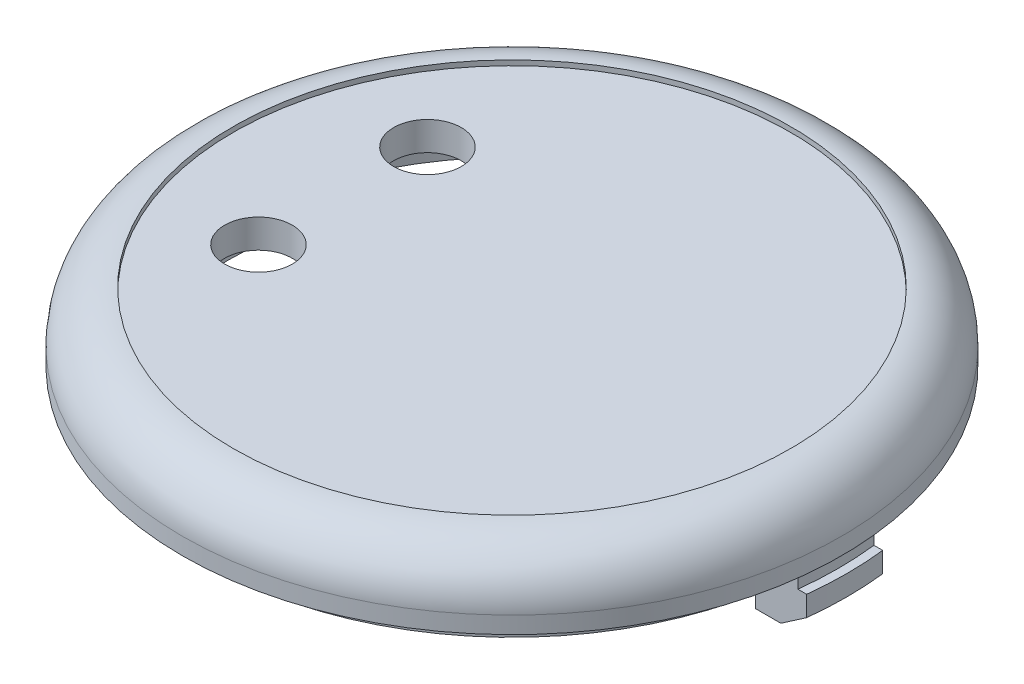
ISO-10303-21;
HEADER;
FILE_DESCRIPTION(('STEP AP214'),'2;1');
FILE_NAME('part.step','',(''),(''),'','','');
FILE_SCHEMA(('AUTOMOTIVE_DESIGN { 1 0 10303 214 1 1 1 1 }'));
ENDSEC;
DATA;
#1=APPLICATION_CONTEXT('core data for automotive mechanical design processes');
#2=APPLICATION_PROTOCOL_DEFINITION('international standard','automotive_design',2000,#1);
#3=PRODUCT_CONTEXT('',#1,'mechanical');
#4=PRODUCT('Part','Part','',(#3));
#5=PRODUCT_RELATED_PRODUCT_CATEGORY('part','',(#4));
#6=PRODUCT_DEFINITION_FORMATION('','',#4);
#7=PRODUCT_DEFINITION_CONTEXT('part definition',#1,'design');
#8=PRODUCT_DEFINITION('design','',#6,#7);
#9=PRODUCT_DEFINITION_SHAPE('','',#8);
#10=(LENGTH_UNIT() NAMED_UNIT(*) SI_UNIT(.MILLI.,.METRE.));
#11=(NAMED_UNIT(*) PLANE_ANGLE_UNIT() SI_UNIT($,.RADIAN.));
#12=(NAMED_UNIT(*) SI_UNIT($,.STERADIAN.) SOLID_ANGLE_UNIT());
#13=UNCERTAINTY_MEASURE_WITH_UNIT(LENGTH_MEASURE(1.E-05),#10,'distance_accuracy_value','');
#14=(GEOMETRIC_REPRESENTATION_CONTEXT(3) GLOBAL_UNCERTAINTY_ASSIGNED_CONTEXT((#13)) GLOBAL_UNIT_ASSIGNED_CONTEXT((#10,
#11,#12)) REPRESENTATION_CONTEXT('',''));
#15=CARTESIAN_POINT('',(0.,0.,0.));
#16=DIRECTION('',(0.,0.,1.));
#17=DIRECTION('',(1.,0.,0.));
#18=AXIS2_PLACEMENT_3D('',#15,#16,#17);
#19=CARTESIAN_POINT('',(0.,-0.75,0.));
#20=DIRECTION('',(0.,1.,0.));
#21=DIRECTION('',(0.,0.,1.));
#22=AXIS2_PLACEMENT_3D('',#19,#20,#21);
#23=PLANE('',#22);
#24=CARTESIAN_POINT('',(0.,-0.75,0.));
#25=DIRECTION('',(0.,1.,0.));
#26=DIRECTION('',(0.,0.,1.));
#27=AXIS2_PLACEMENT_3D('',#24,#25,#26);
#28=CIRCLE('',#27,19.81639257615);
#29=CARTESIAN_POINT('',(-19.6882430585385,-0.75,2.25000000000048));
#30=VERTEX_POINT('',#29);
#31=CARTESIAN_POINT('',(-19.6882430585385,-0.75,-2.25000000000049));
#32=VERTEX_POINT('',#31);
#33=EDGE_CURVE('E187',#30,#32,#28,.F.);
#34=ORIENTED_EDGE('',*,*,#33,.F.);
#35=DIRECTION('',(1.,0.,0.));
#36=VECTOR('',#35,1.);
#37=CARTESIAN_POINT('',(0.,-0.75,2.25));
#38=LINE('',#37,#36);
#39=CARTESIAN_POINT('',(-19.1683984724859,-0.75,2.24999999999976));
#40=VERTEX_POINT('',#39);
#41=EDGE_CURVE('E201',#30,#40,#38,.T.);
#42=ORIENTED_EDGE('',*,*,#41,.T.);
#43=CARTESIAN_POINT('',(0.,-0.75,0.));
#44=DIRECTION('',(0.,1.,0.));
#45=DIRECTION('',(0.,0.,1.));
#46=AXIS2_PLACEMENT_3D('',#43,#44,#45);
#47=CIRCLE('',#46,19.3);
#48=CARTESIAN_POINT('',(-19.1683984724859,-0.75,-2.24999999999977));
#49=VERTEX_POINT('',#48);
#50=EDGE_CURVE('E423',#49,#40,#47,.T.);
#51=ORIENTED_EDGE('',*,*,#50,.F.);
#52=DIRECTION('',(1.,0.,0.));
#53=VECTOR('',#52,1.);
#54=CARTESIAN_POINT('',(0.,-0.75,-2.25));
#55=LINE('',#54,#53);
#56=EDGE_CURVE('E203',#49,#32,#55,.F.);
#57=ORIENTED_EDGE('',*,*,#56,.T.);
#58=EDGE_LOOP('',(#34,#42,#51,#57));
#59=FACE_BOUND('',#58,.T.);
#60=ADVANCED_FACE('F17',(#59),#23,.T.);
#61=CARTESIAN_POINT('',(0.,-0.75,0.));
#62=DIRECTION('',(0.,1.,0.));
#63=DIRECTION('',(0.,0.,1.));
#64=AXIS2_PLACEMENT_3D('',#61,#62,#63);
#65=PLANE('',#64);
#66=CARTESIAN_POINT('',(0.,-0.75,0.));
#67=DIRECTION('',(0.,1.,0.));
#68=DIRECTION('',(0.,0.,1.));
#69=AXIS2_PLACEMENT_3D('',#66,#67,#68);
#70=CIRCLE('',#69,19.3);
#71=CARTESIAN_POINT('',(19.1683984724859,-0.75,2.24999999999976));
#72=VERTEX_POINT('',#71);
#73=CARTESIAN_POINT('',(19.1683984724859,-0.75,-2.24999999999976));
#74=VERTEX_POINT('',#73);
#75=EDGE_CURVE('E174',#72,#74,#70,.T.);
#76=ORIENTED_EDGE('',*,*,#75,.F.);
#77=DIRECTION('',(1.,0.,0.));
#78=VECTOR('',#77,1.);
#79=CARTESIAN_POINT('',(0.,-0.75,2.25));
#80=LINE('',#79,#78);
#81=CARTESIAN_POINT('',(19.6882430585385,-0.75,2.25000000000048));
#82=VERTEX_POINT('',#81);
#83=EDGE_CURVE('E168',#72,#82,#80,.T.);
#84=ORIENTED_EDGE('',*,*,#83,.T.);
#85=CARTESIAN_POINT('',(0.,-0.75,0.));
#86=DIRECTION('',(0.,1.,0.));
#87=DIRECTION('',(0.,0.,1.));
#88=AXIS2_PLACEMENT_3D('',#85,#86,#87);
#89=CIRCLE('',#88,19.81639257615);
#90=CARTESIAN_POINT('',(19.6882430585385,-0.75,-2.25000000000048));
#91=VERTEX_POINT('',#90);
#92=EDGE_CURVE('E20',#91,#82,#89,.F.);
#93=ORIENTED_EDGE('',*,*,#92,.F.);
#94=DIRECTION('',(1.,0.,0.));
#95=VECTOR('',#94,1.);
#96=CARTESIAN_POINT('',(0.,-0.75,-2.25));
#97=LINE('',#96,#95);
#98=EDGE_CURVE('E163',#91,#74,#97,.F.);
#99=ORIENTED_EDGE('',*,*,#98,.T.);
#100=EDGE_LOOP('',(#76,#84,#93,#99));
#101=FACE_BOUND('',#100,.T.);
#102=ADVANCED_FACE('F170',(#101),#65,.T.);
#103=CARTESIAN_POINT('',(0.,-3.15,0.));
#104=DIRECTION('',(0.,1.,0.));
#105=DIRECTION('',(0.,0.,1.));
#106=AXIS2_PLACEMENT_3D('',#103,#104,#105);
#107=CYLINDRICAL_SURFACE('',#106,19.81639257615);
#108=ORIENTED_EDGE('',*,*,#92,.T.);
#109=DIRECTION('',(0.,1.,0.));
#110=VECTOR('',#109,1.);
#111=CARTESIAN_POINT('',(19.6882430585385,-3.15,2.25000000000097));
#112=LINE('',#111,#110);
#113=CARTESIAN_POINT('',(19.6882430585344,-1.94999999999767,2.25000000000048));
#114=VERTEX_POINT('',#113);
#115=EDGE_CURVE('E180',#82,#114,#112,.F.);
#116=ORIENTED_EDGE('',*,*,#115,.T.);
#117=CARTESIAN_POINT('',(0.,-1.9500000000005,0.));
#118=DIRECTION('',(0.,1.,0.));
#119=DIRECTION('',(-0.990268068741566,0.,-0.139173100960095));
#120=AXIS2_PLACEMENT_3D('',#117,#118,#119);
#121=CIRCLE('',#120,19.8163925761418);
#122=CARTESIAN_POINT('',(19.6882430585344,-1.94999999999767,-2.25000000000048));
#123=VERTEX_POINT('',#122);
#124=EDGE_CURVE('E197',#123,#114,#121,.F.);
#125=ORIENTED_EDGE('',*,*,#124,.F.);
#126=DIRECTION('',(0.,1.,0.));
#127=VECTOR('',#126,1.);
#128=CARTESIAN_POINT('',(19.6882430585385,-3.15,-2.25000000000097));
#129=LINE('',#128,#127);
#130=EDGE_CURVE('E177',#123,#91,#129,.T.);
#131=ORIENTED_EDGE('',*,*,#130,.T.);
#132=EDGE_LOOP('',(#108,#116,#125,#131));
#133=FACE_BOUND('',#132,.T.);
#134=ADVANCED_FACE('F189',(#133),#107,.T.);
#135=CARTESIAN_POINT('',(0.,-3.15,0.));
#136=DIRECTION('',(0.,1.,0.));
#137=DIRECTION('',(0.,0.,1.));
#138=AXIS2_PLACEMENT_3D('',#135,#136,#137);
#139=CYLINDRICAL_SURFACE('',#138,19.81639257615);
#140=CARTESIAN_POINT('',(0.,-1.9500000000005,0.));
#141=DIRECTION('',(0.,1.,0.));
#142=DIRECTION('',(0.990268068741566,0.,0.139173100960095));
#143=AXIS2_PLACEMENT_3D('',#140,#141,#142);
#144=CIRCLE('',#143,19.8163925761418);
#145=CARTESIAN_POINT('',(-19.6882430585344,-1.94999999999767,2.25000000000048));
#146=VERTEX_POINT('',#145);
#147=CARTESIAN_POINT('',(-19.6882430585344,-1.94999999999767,-2.25000000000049));
#148=VERTEX_POINT('',#147);
#149=EDGE_CURVE('E399',#146,#148,#144,.F.);
#150=ORIENTED_EDGE('',*,*,#149,.F.);
#151=DIRECTION('',(0.,1.,0.));
#152=VECTOR('',#151,1.);
#153=CARTESIAN_POINT('',(-19.6882430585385,-3.15,2.25000000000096));
#154=LINE('',#153,#152);
#155=EDGE_CURVE('E426',#146,#30,#154,.T.);
#156=ORIENTED_EDGE('',*,*,#155,.T.);
#157=ORIENTED_EDGE('',*,*,#33,.T.);
#158=DIRECTION('',(0.,1.,0.));
#159=VECTOR('',#158,1.);
#160=CARTESIAN_POINT('',(-19.6882430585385,-3.15,-2.25000000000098));
#161=LINE('',#160,#159);
#162=EDGE_CURVE('E192',#32,#148,#161,.F.);
#163=ORIENTED_EDGE('',*,*,#162,.T.);
#164=EDGE_LOOP('',(#150,#156,#157,#163));
#165=FACE_BOUND('',#164,.T.);
#166=ADVANCED_FACE('F646',(#165),#139,.T.);
#167=CARTESIAN_POINT('',(0.,0.,0.));
#168=DIRECTION('',(0.,1.,0.));
#169=DIRECTION('',(0.,0.,1.));
#170=AXIS2_PLACEMENT_3D('',#167,#168,#169);
#171=CYLINDRICAL_SURFACE('',#170,19.5);
#172=CARTESIAN_POINT('',(0.,0.,0.));
#173=DIRECTION('',(0.,1.,0.));
#174=DIRECTION('',(0.,0.,1.));
#175=AXIS2_PLACEMENT_3D('',#172,#173,#174);
#176=CIRCLE('',#175,19.5);
#177=CARTESIAN_POINT('',(0.,0.,19.5));
#178=VERTEX_POINT('',#177);
#179=EDGE_CURVE('E402',#178,#178,#176,.T.);
#180=ORIENTED_EDGE('',*,*,#179,.T.);
#181=EDGE_LOOP('',(#180));
#182=FACE_BOUND('',#181,.T.);
#183=CARTESIAN_POINT('',(0.,1.,0.));
#184=DIRECTION('',(0.,1.,0.));
#185=DIRECTION('',(-0.999990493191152,0.,-0.00436045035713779));
#186=AXIS2_PLACEMENT_3D('',#183,#184,#185);
#187=CIRCLE('',#186,19.5);
#188=CARTESIAN_POINT('',(-19.4998146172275,1.,-0.0850287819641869));
#189=VERTEX_POINT('',#188);
#190=EDGE_CURVE('E195',#189,#189,#187,.T.);
#191=ORIENTED_EDGE('',*,*,#190,.F.);
#192=EDGE_LOOP('',(#191));
#193=FACE_BOUND('',#192,.T.);
#194=ADVANCED_FACE('F639',(#182,#193),#171,.T.);
#195=CARTESIAN_POINT('',(0.,-3.15,0.));
#196=DIRECTION('',(0.,1.,0.));
#197=DIRECTION('',(0.,0.,1.));
#198=AXIS2_PLACEMENT_3D('',#195,#196,#197);
#199=CYLINDRICAL_SURFACE('',#198,19.3);
#200=ORIENTED_EDGE('',*,*,#50,.T.);
#201=DIRECTION('',(0.,1.,0.));
#202=VECTOR('',#201,1.);
#203=CARTESIAN_POINT('',(-19.168398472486,-3.15,2.24999999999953));
#204=LINE('',#203,#202);
#205=CARTESIAN_POINT('',(-19.1683984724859,0.,2.24999999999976));
#206=VERTEX_POINT('',#205);
#207=EDGE_CURVE('E421',#40,#206,#204,.T.);
#208=ORIENTED_EDGE('',*,*,#207,.T.);
#209=CARTESIAN_POINT('',(0.,0.,0.));
#210=DIRECTION('',(0.,1.,0.));
#211=DIRECTION('',(0.,0.,1.));
#212=AXIS2_PLACEMENT_3D('',#209,#210,#211);
#213=CIRCLE('',#212,19.3);
#214=CARTESIAN_POINT('',(-19.1683984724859,0.,-2.24999999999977));
#215=VERTEX_POINT('',#214);
#216=EDGE_CURVE('E441',#206,#215,#213,.F.);
#217=ORIENTED_EDGE('',*,*,#216,.T.);
#218=DIRECTION('',(0.,1.,0.));
#219=VECTOR('',#218,1.);
#220=CARTESIAN_POINT('',(-19.168398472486,-3.15,-2.24999999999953));
#221=LINE('',#220,#219);
#222=EDGE_CURVE('E424',#215,#49,#221,.F.);
#223=ORIENTED_EDGE('',*,*,#222,.T.);
#224=EDGE_LOOP('',(#200,#208,#217,#223));
#225=FACE_BOUND('',#224,.T.);
#226=ADVANCED_FACE('F588',(#225),#199,.T.);
#227=CARTESIAN_POINT('',(0.,-3.15,0.));
#228=DIRECTION('',(0.,1.,0.));
#229=DIRECTION('',(0.,0.,1.));
#230=AXIS2_PLACEMENT_3D('',#227,#228,#229);
#231=CYLINDRICAL_SURFACE('',#230,19.3);
#232=CARTESIAN_POINT('',(0.,0.,0.));
#233=DIRECTION('',(0.,1.,0.));
#234=DIRECTION('',(0.,0.,1.));
#235=AXIS2_PLACEMENT_3D('',#232,#233,#234);
#236=CIRCLE('',#235,19.3);
#237=CARTESIAN_POINT('',(19.1683984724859,0.,-2.24999999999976));
#238=VERTEX_POINT('',#237);
#239=CARTESIAN_POINT('',(19.1683984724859,0.,2.24999999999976));
#240=VERTEX_POINT('',#239);
#241=EDGE_CURVE('E450',#238,#240,#236,.F.);
#242=ORIENTED_EDGE('',*,*,#241,.T.);
#243=DIRECTION('',(0.,1.,0.));
#244=VECTOR('',#243,1.);
#245=CARTESIAN_POINT('',(19.168398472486,-3.15,2.24999999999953));
#246=LINE('',#245,#244);
#247=EDGE_CURVE('E198',#240,#72,#246,.F.);
#248=ORIENTED_EDGE('',*,*,#247,.T.);
#249=ORIENTED_EDGE('',*,*,#75,.T.);
#250=DIRECTION('',(0.,1.,0.));
#251=VECTOR('',#250,1.);
#252=CARTESIAN_POINT('',(19.168398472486,-3.15,-2.24999999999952));
#253=LINE('',#252,#251);
#254=EDGE_CURVE('E418',#74,#238,#253,.T.);
#255=ORIENTED_EDGE('',*,*,#254,.T.);
#256=EDGE_LOOP('',(#242,#248,#249,#255));
#257=FACE_BOUND('',#256,.T.);
#258=ADVANCED_FACE('F500',(#257),#231,.T.);
#259=CARTESIAN_POINT('',(0.,1.,0.));
#260=DIRECTION('',(0.,1.,0.));
#261=DIRECTION('',(-0.999990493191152,0.,-0.00436045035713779));
#262=AXIS2_PLACEMENT_3D('',#259,#260,#261);
#263=TOROIDAL_SURFACE('',#262,16.5,3.);
#264=ORIENTED_EDGE('',*,*,#190,.T.);
#265=EDGE_LOOP('',(#264));
#266=FACE_BOUND('',#265,.T.);
#267=CARTESIAN_POINT('',(0.,4.,0.));
#268=DIRECTION('',(0.,1.,0.));
#269=DIRECTION('',(0.,0.,1.));
#270=AXIS2_PLACEMENT_3D('',#267,#268,#269);
#271=CIRCLE('',#270,16.5);
#272=CARTESIAN_POINT('',(0.,4.,16.5));
#273=VERTEX_POINT('',#272);
#274=EDGE_CURVE('E394',#273,#273,#271,.F.);
#275=ORIENTED_EDGE('',*,*,#274,.T.);
#276=EDGE_LOOP('',(#275));
#277=FACE_BOUND('',#276,.T.);
#278=ADVANCED_FACE('F315',(#266,#277),#263,.T.);
#279=CARTESIAN_POINT('',(0.,-1.9500000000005,0.));
#280=DIRECTION('',(0.,1.,0.));
#281=DIRECTION('',(0.,0.,1.));
#282=AXIS2_PLACEMENT_3D('',#279,#280,#281);
#283=CONICAL_SURFACE('',#282,19.8163925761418,0.965167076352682);
#284=ORIENTED_EDGE('',*,*,#124,.T.);
#285=CARTESIAN_POINT('',(19.6882430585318,-1.94999999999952,2.25));
#286=CARTESIAN_POINT('',(19.4337741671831,-2.1250669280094,2.25));
#287=CARTESIAN_POINT('',(19.1792822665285,-2.30010039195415,2.25));
#288=CARTESIAN_POINT('',(18.6702524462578,-2.6501003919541,2.25));
#289=CARTESIAN_POINT('',(18.4157145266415,-2.8250669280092,2.25));
#290=CARTESIAN_POINT('',(18.1611535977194,-2.99999999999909,2.25));
#291=B_SPLINE_CURVE_WITH_KNOTS('',3,(#285,#286,#287,#288,#289,#290),.UNSPECIFIED.,.F.,.F.,(4,2,
4),(0.,0.926620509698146,1.85324102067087),.UNSPECIFIED.);
#292=CARTESIAN_POINT('',(18.1611535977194,-2.99999999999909,2.25));
#293=VERTEX_POINT('',#292);
#294=EDGE_CURVE('E183',#114,#293,#291,.T.);
#295=ORIENTED_EDGE('',*,*,#294,.T.);
#296=CARTESIAN_POINT('',(0.,-2.99999999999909,0.));
#297=DIRECTION('',(0.,1.,0.));
#298=DIRECTION('',(0.,0.,1.));
#299=AXIS2_PLACEMENT_3D('',#296,#297,#298);
#300=CIRCLE('',#299,18.2999999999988);
#301=CARTESIAN_POINT('',(18.1611535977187,-2.99999999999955,-2.25));
#302=VERTEX_POINT('',#301);
#303=EDGE_CURVE('E309',#293,#302,#300,.T.);
#304=ORIENTED_EDGE('',*,*,#303,.T.);
#305=CARTESIAN_POINT('',(18.1611535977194,-2.99999999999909,-2.25));
#306=CARTESIAN_POINT('',(18.4157145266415,-2.8250669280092,-2.25));
#307=CARTESIAN_POINT('',(18.6702524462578,-2.6501003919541,-2.25));
#308=CARTESIAN_POINT('',(19.1792822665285,-2.30010039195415,-2.25));
#309=CARTESIAN_POINT('',(19.4337741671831,-2.1250669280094,-2.25));
#310=CARTESIAN_POINT('',(19.6882430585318,-1.94999999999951,-2.25));
#311=B_SPLINE_CURVE_WITH_KNOTS('',3,(#305,#306,#307,#308,#309,#310),.UNSPECIFIED.,.F.,.F.,(4,2,
4),(0.,0.926620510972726,1.85324102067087),.UNSPECIFIED.);
#312=EDGE_CURVE('E301',#302,#123,#311,.T.);
#313=ORIENTED_EDGE('',*,*,#312,.T.);
#314=EDGE_LOOP('',(#284,#295,#304,#313));
#315=FACE_BOUND('',#314,.T.);
#316=ADVANCED_FACE('F311',(#315),#283,.T.);
#317=CARTESIAN_POINT('',(0.,0.,0.));
#318=DIRECTION('',(0.,-1.,0.));
#319=DIRECTION('',(0.,0.,-1.));
#320=AXIS2_PLACEMENT_3D('',#317,#318,#319);
#321=CYLINDRICAL_SURFACE('',#320,18.);
#322=CARTESIAN_POINT('',(0.,-1.2,0.));
#323=DIRECTION('',(0.,-1.,0.));
#324=DIRECTION('',(0.,0.,-1.));
#325=AXIS2_PLACEMENT_3D('',#322,#323,#324);
#326=CIRCLE('',#325,18.);
#327=CARTESIAN_POINT('',(-17.7482393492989,-1.2,-2.9999999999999));
#328=VERTEX_POINT('',#327);
#329=CARTESIAN_POINT('',(17.7482393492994,-1.2,-3.));
#330=VERTEX_POINT('',#329);
#331=EDGE_CURVE('E275',#328,#330,#326,.T.);
#332=ORIENTED_EDGE('',*,*,#331,.F.);
#333=DIRECTION('',(0.,-1.,0.));
#334=VECTOR('',#333,1.);
#335=CARTESIAN_POINT('',(-17.7482393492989,0.,-2.9999999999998));
#336=LINE('',#335,#334);
#337=CARTESIAN_POINT('',(-17.7482393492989,0.,-2.9999999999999));
#338=VERTEX_POINT('',#337);
#339=EDGE_CURVE('E403',#328,#338,#336,.F.);
#340=ORIENTED_EDGE('',*,*,#339,.T.);
#341=CARTESIAN_POINT('',(0.,0.,0.));
#342=DIRECTION('',(0.,-1.,0.));
#343=DIRECTION('',(0.,0.,-1.));
#344=AXIS2_PLACEMENT_3D('',#341,#342,#343);
#345=CIRCLE('',#344,18.);
#346=CARTESIAN_POINT('',(17.7482393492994,0.,-3.));
#347=VERTEX_POINT('',#346);
#348=EDGE_CURVE('E446',#338,#347,#345,.T.);
#349=ORIENTED_EDGE('',*,*,#348,.T.);
#350=DIRECTION('',(0.,1.,0.));
#351=VECTOR('',#350,1.);
#352=CARTESIAN_POINT('',(17.7482393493,0.,-3.));
#353=LINE('',#352,#351);
#354=EDGE_CURVE('E408',#347,#330,#353,.F.);
#355=ORIENTED_EDGE('',*,*,#354,.T.);
#356=EDGE_LOOP('',(#332,#340,#349,#355));
#357=FACE_BOUND('',#356,.T.);
#358=ADVANCED_FACE('F262',(#357),#321,.T.);
#359=CARTESIAN_POINT('',(0.,-1.9500000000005,0.));
#360=DIRECTION('',(0.,1.,0.));
#361=DIRECTION('',(0.,0.,1.));
#362=AXIS2_PLACEMENT_3D('',#359,#360,#361);
#363=CONICAL_SURFACE('',#362,19.8163925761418,0.965167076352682);
#364=CARTESIAN_POINT('',(0.,-2.99999999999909,0.));
#365=DIRECTION('',(0.,1.,0.));
#366=DIRECTION('',(0.,0.,1.));
#367=AXIS2_PLACEMENT_3D('',#364,#365,#366);
#368=CIRCLE('',#367,18.2999999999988);
#369=CARTESIAN_POINT('',(-18.1611535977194,-2.99999999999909,-2.25));
#370=VERTEX_POINT('',#369);
#371=CARTESIAN_POINT('',(-18.1611535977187,-2.99999999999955,2.25));
#372=VERTEX_POINT('',#371);
#373=EDGE_CURVE('E250',#370,#372,#368,.T.);
#374=ORIENTED_EDGE('',*,*,#373,.T.);
#375=CARTESIAN_POINT('',(-18.1611535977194,-2.99999999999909,2.25));
#376=CARTESIAN_POINT('',(-18.4157145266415,-2.8250669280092,2.25));
#377=CARTESIAN_POINT('',(-18.6702524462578,-2.6501003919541,2.25));
#378=CARTESIAN_POINT('',(-19.1792822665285,-2.30010039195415,2.25));
#379=CARTESIAN_POINT('',(-19.4337741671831,-2.1250669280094,2.25));
#380=CARTESIAN_POINT('',(-19.6882430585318,-1.94999999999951,2.25));
#381=B_SPLINE_CURVE_WITH_KNOTS('',3,(#375,#376,#377,#378,#379,#380),.UNSPECIFIED.,.F.,.F.,(4,2,
4),(0.,0.926620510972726,1.85324102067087),.UNSPECIFIED.);
#382=EDGE_CURVE('E240',#372,#146,#381,.T.);
#383=ORIENTED_EDGE('',*,*,#382,.T.);
#384=ORIENTED_EDGE('',*,*,#149,.T.);
#385=CARTESIAN_POINT('',(-19.6882430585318,-1.94999999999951,-2.25));
#386=CARTESIAN_POINT('',(-19.4337741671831,-2.1250669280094,-2.25));
#387=CARTESIAN_POINT('',(-19.1792822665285,-2.30010039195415,-2.25));
#388=CARTESIAN_POINT('',(-18.6702524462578,-2.6501003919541,-2.25));
#389=CARTESIAN_POINT('',(-18.4157145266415,-2.8250669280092,-2.25));
#390=CARTESIAN_POINT('',(-18.1611535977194,-2.99999999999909,-2.25));
#391=B_SPLINE_CURVE_WITH_KNOTS('',3,(#385,#386,#387,#388,#389,#390),.UNSPECIFIED.,.F.,.F.,(4,2,
4),(0.,0.926620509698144,1.85324102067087),.UNSPECIFIED.);
#392=EDGE_CURVE('E267',#148,#370,#391,.T.);
#393=ORIENTED_EDGE('',*,*,#392,.T.);
#394=EDGE_LOOP('',(#374,#383,#384,#393));
#395=FACE_BOUND('',#394,.T.);
#396=ADVANCED_FACE('F256',(#395),#363,.T.);
#397=CARTESIAN_POINT('',(0.,0.,0.));
#398=DIRECTION('',(0.,1.,0.));
#399=DIRECTION('',(0.,0.,1.));
#400=AXIS2_PLACEMENT_3D('',#397,#398,#399);
#401=PLANE('',#400);
#402=CARTESIAN_POINT('',(0.,0.,0.));
#403=DIRECTION('',(0.,-1.,0.));
#404=DIRECTION('',(0.,0.,-1.));
#405=AXIS2_PLACEMENT_3D('',#402,#403,#404);
#406=CIRCLE('',#405,18.);
#407=CARTESIAN_POINT('',(17.7482393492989,0.,2.9999999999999));
#408=VERTEX_POINT('',#407);
#409=CARTESIAN_POINT('',(-17.7482393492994,0.,3.));
#410=VERTEX_POINT('',#409);
#411=EDGE_CURVE('E326',#408,#410,#406,.T.);
#412=ORIENTED_EDGE('',*,*,#411,.F.);
#413=DIRECTION('',(1.,0.,0.));
#414=VECTOR('',#413,1.);
#415=CARTESIAN_POINT('',(0.,0.,3.));
#416=LINE('',#415,#414);
#417=CARTESIAN_POINT('',(16.5299727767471,0.,2.99999999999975));
#418=VERTEX_POINT('',#417);
#419=EDGE_CURVE('E396',#418,#408,#416,.T.);
#420=ORIENTED_EDGE('',*,*,#419,.F.);
#421=CARTESIAN_POINT('',(0.,0.,0.));
#422=DIRECTION('',(0.,-1.,0.));
#423=DIRECTION('',(0.,0.,-1.));
#424=AXIS2_PLACEMENT_3D('',#421,#422,#423);
#425=CIRCLE('',#424,16.8);
#426=CARTESIAN_POINT('',(16.6486485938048,0.,2.25000000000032));
#427=VERTEX_POINT('',#426);
#428=EDGE_CURVE('E397',#427,#418,#425,.T.);
#429=ORIENTED_EDGE('',*,*,#428,.F.);
#430=DIRECTION('',(-1.,0.,0.));
#431=VECTOR('',#430,1.);
#432=CARTESIAN_POINT('',(-22.51621559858,0.,2.25));
#433=LINE('',#432,#431);
#434=EDGE_CURVE('E325',#427,#240,#433,.F.);
#435=ORIENTED_EDGE('',*,*,#434,.T.);
#436=ORIENTED_EDGE('',*,*,#241,.F.);
#437=DIRECTION('',(1.,0.,0.));
#438=VECTOR('',#437,1.);
#439=CARTESIAN_POINT('',(22.51621559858,0.,-2.25));
#440=LINE('',#439,#438);
#441=CARTESIAN_POINT('',(16.6486485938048,0.,-2.25000000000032));
#442=VERTEX_POINT('',#441);
#443=EDGE_CURVE('E307',#238,#442,#440,.F.);
#444=ORIENTED_EDGE('',*,*,#443,.T.);
#445=CARTESIAN_POINT('',(0.,0.,0.));
#446=DIRECTION('',(0.,-1.,0.));
#447=DIRECTION('',(0.,0.,-1.));
#448=AXIS2_PLACEMENT_3D('',#445,#446,#447);
#449=CIRCLE('',#448,16.8);
#450=CARTESIAN_POINT('',(16.5299727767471,0.,-2.99999999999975));
#451=VERTEX_POINT('',#450);
#452=EDGE_CURVE('E448',#451,#442,#449,.T.);
#453=ORIENTED_EDGE('',*,*,#452,.F.);
#454=DIRECTION('',(-1.,0.,0.));
#455=VECTOR('',#454,1.);
#456=CARTESIAN_POINT('',(-22.51621559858,0.,-3.));
#457=LINE('',#456,#455);
#458=EDGE_CURVE('E410',#451,#347,#457,.F.);
#459=ORIENTED_EDGE('',*,*,#458,.T.);
#460=ORIENTED_EDGE('',*,*,#348,.F.);
#461=DIRECTION('',(-1.,0.,0.));
#462=VECTOR('',#461,1.);
#463=CARTESIAN_POINT('',(-22.51621559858,0.,-3.));
#464=LINE('',#463,#462);
#465=CARTESIAN_POINT('',(-16.5299727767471,0.,-2.99999999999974));
#466=VERTEX_POINT('',#465);
#467=EDGE_CURVE('E404',#338,#466,#464,.F.);
#468=ORIENTED_EDGE('',*,*,#467,.T.);
#469=CARTESIAN_POINT('',(0.,0.,0.));
#470=DIRECTION('',(0.,-1.,0.));
#471=DIRECTION('',(0.,0.,-1.));
#472=AXIS2_PLACEMENT_3D('',#469,#470,#471);
#473=CIRCLE('',#472,16.8);
#474=CARTESIAN_POINT('',(-16.6486485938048,0.,-2.25000000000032));
#475=VERTEX_POINT('',#474);
#476=EDGE_CURVE('E444',#475,#466,#473,.T.);
#477=ORIENTED_EDGE('',*,*,#476,.F.);
#478=DIRECTION('',(1.,0.,0.));
#479=VECTOR('',#478,1.);
#480=CARTESIAN_POINT('',(22.51621559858,0.,-2.25));
#481=LINE('',#480,#479);
#482=EDGE_CURVE('E274',#475,#215,#481,.F.);
#483=ORIENTED_EDGE('',*,*,#482,.T.);
#484=ORIENTED_EDGE('',*,*,#216,.F.);
#485=DIRECTION('',(-1.,0.,0.));
#486=VECTOR('',#485,1.);
#487=CARTESIAN_POINT('',(-22.51621559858,0.,2.25));
#488=LINE('',#487,#486);
#489=CARTESIAN_POINT('',(-16.6486485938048,0.,2.25000000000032));
#490=VERTEX_POINT('',#489);
#491=EDGE_CURVE('E248',#206,#490,#488,.F.);
#492=ORIENTED_EDGE('',*,*,#491,.T.);
#493=CARTESIAN_POINT('',(0.,0.,0.));
#494=DIRECTION('',(0.,-1.,0.));
#495=DIRECTION('',(0.,0.,-1.));
#496=AXIS2_PLACEMENT_3D('',#493,#494,#495);
#497=CIRCLE('',#496,16.8);
#498=CARTESIAN_POINT('',(-16.5299727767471,0.,2.99999999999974));
#499=VERTEX_POINT('',#498);
#500=EDGE_CURVE('E439',#499,#490,#497,.T.);
#501=ORIENTED_EDGE('',*,*,#500,.F.);
#502=DIRECTION('',(1.,0.,0.));
#503=VECTOR('',#502,1.);
#504=CARTESIAN_POINT('',(0.,0.,3.));
#505=LINE('',#504,#503);
#506=EDGE_CURVE('E382',#410,#499,#505,.T.);
#507=ORIENTED_EDGE('',*,*,#506,.F.);
#508=EDGE_LOOP('',(#412,#420,#429,#435,#436,#444,#453,#459,#460,#468,#477,#483,#484,#492,#501,#507));
#509=FACE_BOUND('',#508,.T.);
#510=ORIENTED_EDGE('',*,*,#179,.F.);
#511=EDGE_LOOP('',(#510));
#512=FACE_BOUND('',#511,.T.);
#513=ADVANCED_FACE('F261',(#509,#512),#401,.F.);
#514=CARTESIAN_POINT('',(0.,0.,0.));
#515=DIRECTION('',(0.,-1.,0.));
#516=DIRECTION('',(0.,0.,-1.));
#517=AXIS2_PLACEMENT_3D('',#514,#515,#516);
#518=CYLINDRICAL_SURFACE('',#517,18.);
#519=CARTESIAN_POINT('',(0.,-1.2,0.));
#520=DIRECTION('',(0.,-1.,0.));
#521=DIRECTION('',(0.,0.,-1.));
#522=AXIS2_PLACEMENT_3D('',#519,#520,#521);
#523=CIRCLE('',#522,18.);
#524=CARTESIAN_POINT('',(17.7482393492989,-1.2,2.9999999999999));
#525=VERTEX_POINT('',#524);
#526=CARTESIAN_POINT('',(-17.7482393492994,-1.2,3.));
#527=VERTEX_POINT('',#526);
#528=EDGE_CURVE('E235',#525,#527,#523,.T.);
#529=ORIENTED_EDGE('',*,*,#528,.F.);
#530=DIRECTION('',(0.,-1.,0.));
#531=VECTOR('',#530,1.);
#532=CARTESIAN_POINT('',(17.7482393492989,0.,2.99999999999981));
#533=LINE('',#532,#531);
#534=EDGE_CURVE('E391',#525,#408,#533,.F.);
#535=ORIENTED_EDGE('',*,*,#534,.T.);
#536=ORIENTED_EDGE('',*,*,#411,.T.);
#537=DIRECTION('',(0.,1.,0.));
#538=VECTOR('',#537,1.);
#539=CARTESIAN_POINT('',(-17.7482393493,0.,3.));
#540=LINE('',#539,#538);
#541=EDGE_CURVE('E239',#410,#527,#540,.F.);
#542=ORIENTED_EDGE('',*,*,#541,.T.);
#543=EDGE_LOOP('',(#529,#535,#536,#542));
#544=FACE_BOUND('',#543,.T.);
#545=ADVANCED_FACE('F333',(#544),#518,.T.);
#546=CARTESIAN_POINT('',(0.,4.,0.));
#547=DIRECTION('',(0.,1.,0.));
#548=DIRECTION('',(0.,0.,1.));
#549=AXIS2_PLACEMENT_3D('',#546,#547,#548);
#550=CYLINDRICAL_SURFACE('',#549,16.5);
#551=CARTESIAN_POINT('',(0.,3.7,0.));
#552=DIRECTION('',(0.,1.,0.));
#553=DIRECTION('',(0.,0.,1.));
#554=AXIS2_PLACEMENT_3D('',#551,#552,#553);
#555=CIRCLE('',#554,16.5);
#556=CARTESIAN_POINT('',(0.,3.7,16.5));
#557=VERTEX_POINT('',#556);
#558=EDGE_CURVE('E231',#557,#557,#555,.T.);
#559=ORIENTED_EDGE('',*,*,#558,.F.);
#560=EDGE_LOOP('',(#559));
#561=FACE_BOUND('',#560,.T.);
#562=ORIENTED_EDGE('',*,*,#274,.F.);
#563=EDGE_LOOP('',(#562));
#564=FACE_BOUND('',#563,.T.);
#565=ADVANCED_FACE('F331',(#561,#564),#550,.F.);
#566=CARTESIAN_POINT('',(-22.51621559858,0.,2.25));
#567=DIRECTION('',(0.,0.,-1.));
#568=DIRECTION('',(-1.,0.,0.));
#569=AXIS2_PLACEMENT_3D('',#566,#567,#568);
#570=PLANE('',#569);
#571=ORIENTED_EDGE('',*,*,#294,.F.);
#572=ORIENTED_EDGE('',*,*,#115,.F.);
#573=ORIENTED_EDGE('',*,*,#83,.F.);
#574=ORIENTED_EDGE('',*,*,#247,.F.);
#575=ORIENTED_EDGE('',*,*,#434,.F.);
#576=DIRECTION('',(0.,-1.,0.));
#577=VECTOR('',#576,1.);
#578=CARTESIAN_POINT('',(16.6486485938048,0.,2.25000000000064));
#579=LINE('',#578,#577);
#580=CARTESIAN_POINT('',(16.6486485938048,-3.,2.25000000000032));
#581=VERTEX_POINT('',#580);
#582=EDGE_CURVE('E230',#427,#581,#579,.T.);
#583=ORIENTED_EDGE('',*,*,#582,.T.);
#584=DIRECTION('',(1.,0.,0.));
#585=VECTOR('',#584,1.);
#586=CARTESIAN_POINT('',(0.,-3.,2.25));
#587=LINE('',#586,#585);
#588=EDGE_CURVE('E324',#581,#293,#587,.T.);
#589=ORIENTED_EDGE('',*,*,#588,.T.);
#590=EDGE_LOOP('',(#571,#572,#573,#574,#575,#583,#589));
#591=FACE_BOUND('',#590,.T.);
#592=ADVANCED_FACE('F181',(#591),#570,.F.);
#593=CARTESIAN_POINT('',(0.,-3.,0.));
#594=DIRECTION('',(0.,1.,0.));
#595=DIRECTION('',(0.,0.,1.));
#596=AXIS2_PLACEMENT_3D('',#593,#594,#595);
#597=PLANE('',#596);
#598=DIRECTION('',(1.,0.,0.));
#599=VECTOR('',#598,1.);
#600=CARTESIAN_POINT('',(22.51621559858,-3.,-2.25));
#601=LINE('',#600,#599);
#602=CARTESIAN_POINT('',(16.6486485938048,-3.,-2.25000000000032));
#603=VERTEX_POINT('',#602);
#604=EDGE_CURVE('E308',#603,#302,#601,.T.);
#605=ORIENTED_EDGE('',*,*,#604,.T.);
#606=ORIENTED_EDGE('',*,*,#303,.F.);
#607=ORIENTED_EDGE('',*,*,#588,.F.);
#608=CARTESIAN_POINT('',(0.,-3.,0.));
#609=DIRECTION('',(0.,-1.,0.));
#610=DIRECTION('',(0.,0.,-1.));
#611=AXIS2_PLACEMENT_3D('',#608,#609,#610);
#612=CIRCLE('',#611,16.8);
#613=EDGE_CURVE('E227',#581,#603,#612,.F.);
#614=ORIENTED_EDGE('',*,*,#613,.T.);
#615=EDGE_LOOP('',(#605,#606,#607,#614));
#616=FACE_BOUND('',#615,.T.);
#617=ADVANCED_FACE('F299',(#616),#597,.F.);
#618=CARTESIAN_POINT('',(22.51621559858,0.,-2.25));
#619=DIRECTION('',(0.,0.,1.));
#620=DIRECTION('',(1.,0.,0.));
#621=AXIS2_PLACEMENT_3D('',#618,#619,#620);
#622=PLANE('',#621);
#623=ORIENTED_EDGE('',*,*,#254,.F.);
#624=ORIENTED_EDGE('',*,*,#98,.F.);
#625=ORIENTED_EDGE('',*,*,#130,.F.);
#626=ORIENTED_EDGE('',*,*,#312,.F.);
#627=ORIENTED_EDGE('',*,*,#604,.F.);
#628=DIRECTION('',(0.,-1.,0.));
#629=VECTOR('',#628,1.);
#630=CARTESIAN_POINT('',(16.6486485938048,0.,-2.25000000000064));
#631=LINE('',#630,#629);
#632=EDGE_CURVE('E229',#603,#442,#631,.F.);
#633=ORIENTED_EDGE('',*,*,#632,.T.);
#634=ORIENTED_EDGE('',*,*,#443,.F.);
#635=EDGE_LOOP('',(#623,#624,#625,#626,#627,#633,#634));
#636=FACE_BOUND('',#635,.T.);
#637=ADVANCED_FACE('F294',(#636),#622,.F.);
#638=CARTESIAN_POINT('',(-22.51621559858,0.,-3.));
#639=DIRECTION('',(0.,0.,-1.));
#640=DIRECTION('',(-1.,0.,0.));
#641=AXIS2_PLACEMENT_3D('',#638,#639,#640);
#642=PLANE('',#641);
#643=ORIENTED_EDGE('',*,*,#354,.F.);
#644=ORIENTED_EDGE('',*,*,#458,.F.);
#645=DIRECTION('',(0.,-1.,0.));
#646=VECTOR('',#645,1.);
#647=CARTESIAN_POINT('',(16.5299727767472,0.,-2.99999999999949));
#648=LINE('',#647,#646);
#649=CARTESIAN_POINT('',(16.5299727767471,-1.2,-2.99999999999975));
#650=VERTEX_POINT('',#649);
#651=EDGE_CURVE('E226',#451,#650,#648,.T.);
#652=ORIENTED_EDGE('',*,*,#651,.T.);
#653=DIRECTION('',(1.,0.,0.));
#654=VECTOR('',#653,1.);
#655=CARTESIAN_POINT('',(0.,-1.2,-3.));
#656=LINE('',#655,#654);
#657=EDGE_CURVE('E478',#330,#650,#656,.F.);
#658=ORIENTED_EDGE('',*,*,#657,.F.);
#659=EDGE_LOOP('',(#643,#644,#652,#658));
#660=FACE_BOUND('',#659,.T.);
#661=ADVANCED_FACE('F290',(#660),#642,.F.);
#662=CARTESIAN_POINT('',(0.,-1.2,0.));
#663=DIRECTION('',(0.,-1.,0.));
#664=DIRECTION('',(0.,0.,-1.));
#665=AXIS2_PLACEMENT_3D('',#662,#663,#664);
#666=PLANE('',#665);
#667=ORIENTED_EDGE('',*,*,#331,.T.);
#668=ORIENTED_EDGE('',*,*,#657,.T.);
#669=CARTESIAN_POINT('',(0.,-1.2,0.));
#670=DIRECTION('',(0.,-1.,0.));
#671=DIRECTION('',(0.,0.,-1.));
#672=AXIS2_PLACEMENT_3D('',#669,#670,#671);
#673=CIRCLE('',#672,16.8);
#674=CARTESIAN_POINT('',(-16.5299727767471,-1.2,-2.99999999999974));
#675=VERTEX_POINT('',#674);
#676=EDGE_CURVE('E223',#650,#675,#673,.F.);
#677=ORIENTED_EDGE('',*,*,#676,.T.);
#678=DIRECTION('',(-1.,0.,0.));
#679=VECTOR('',#678,1.);
#680=CARTESIAN_POINT('',(-22.51621559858,-1.2,-3.));
#681=LINE('',#680,#679);
#682=EDGE_CURVE('E407',#675,#328,#681,.T.);
#683=ORIENTED_EDGE('',*,*,#682,.T.);
#684=EDGE_LOOP('',(#667,#668,#677,#683));
#685=FACE_BOUND('',#684,.T.);
#686=ADVANCED_FACE('F286',(#685),#666,.T.);
#687=CARTESIAN_POINT('',(-22.51621559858,0.,-3.));
#688=DIRECTION('',(0.,0.,-1.));
#689=DIRECTION('',(-1.,0.,0.));
#690=AXIS2_PLACEMENT_3D('',#687,#688,#689);
#691=PLANE('',#690);
#692=ORIENTED_EDGE('',*,*,#339,.F.);
#693=ORIENTED_EDGE('',*,*,#682,.F.);
#694=DIRECTION('',(0.,-1.,0.));
#695=VECTOR('',#694,1.);
#696=CARTESIAN_POINT('',(-16.5299727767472,0.,-2.99999999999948));
#697=LINE('',#696,#695);
#698=EDGE_CURVE('E225',#675,#466,#697,.F.);
#699=ORIENTED_EDGE('',*,*,#698,.T.);
#700=ORIENTED_EDGE('',*,*,#467,.F.);
#701=EDGE_LOOP('',(#692,#693,#699,#700));
#702=FACE_BOUND('',#701,.T.);
#703=ADVANCED_FACE('F282',(#702),#691,.F.);
#704=CARTESIAN_POINT('',(22.51621559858,0.,-2.25));
#705=DIRECTION('',(0.,0.,1.));
#706=DIRECTION('',(1.,0.,0.));
#707=AXIS2_PLACEMENT_3D('',#704,#705,#706);
#708=PLANE('',#707);
#709=ORIENTED_EDGE('',*,*,#392,.F.);
#710=ORIENTED_EDGE('',*,*,#162,.F.);
#711=ORIENTED_EDGE('',*,*,#56,.F.);
#712=ORIENTED_EDGE('',*,*,#222,.F.);
#713=ORIENTED_EDGE('',*,*,#482,.F.);
#714=DIRECTION('',(0.,-1.,0.));
#715=VECTOR('',#714,1.);
#716=CARTESIAN_POINT('',(-16.6486485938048,0.,-2.25000000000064));
#717=LINE('',#716,#715);
#718=CARTESIAN_POINT('',(-16.6486485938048,-3.,-2.25000000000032));
#719=VERTEX_POINT('',#718);
#720=EDGE_CURVE('E222',#475,#719,#717,.T.);
#721=ORIENTED_EDGE('',*,*,#720,.T.);
#722=DIRECTION('',(1.,0.,0.));
#723=VECTOR('',#722,1.);
#724=CARTESIAN_POINT('',(0.,-3.,-2.25));
#725=LINE('',#724,#723);
#726=EDGE_CURVE('E273',#719,#370,#725,.F.);
#727=ORIENTED_EDGE('',*,*,#726,.T.);
#728=EDGE_LOOP('',(#709,#710,#711,#712,#713,#721,#727));
#729=FACE_BOUND('',#728,.T.);
#730=ADVANCED_FACE('F277',(#729),#708,.F.);
#731=CARTESIAN_POINT('',(0.,-3.,0.));
#732=DIRECTION('',(0.,1.,0.));
#733=DIRECTION('',(0.,0.,1.));
#734=AXIS2_PLACEMENT_3D('',#731,#732,#733);
#735=PLANE('',#734);
#736=ORIENTED_EDGE('',*,*,#726,.F.);
#737=CARTESIAN_POINT('',(0.,-3.,0.));
#738=DIRECTION('',(0.,-1.,0.));
#739=DIRECTION('',(0.,0.,-1.));
#740=AXIS2_PLACEMENT_3D('',#737,#738,#739);
#741=CIRCLE('',#740,16.8);
#742=CARTESIAN_POINT('',(-16.6486485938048,-3.,2.25000000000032));
#743=VERTEX_POINT('',#742);
#744=EDGE_CURVE('E219',#719,#743,#741,.F.);
#745=ORIENTED_EDGE('',*,*,#744,.T.);
#746=DIRECTION('',(-1.,0.,0.));
#747=VECTOR('',#746,1.);
#748=CARTESIAN_POINT('',(-22.51621559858,-3.,2.25));
#749=LINE('',#748,#747);
#750=EDGE_CURVE('E249',#743,#372,#749,.T.);
#751=ORIENTED_EDGE('',*,*,#750,.T.);
#752=ORIENTED_EDGE('',*,*,#373,.F.);
#753=EDGE_LOOP('',(#736,#745,#751,#752));
#754=FACE_BOUND('',#753,.T.);
#755=ADVANCED_FACE('F281',(#754),#735,.F.);
#756=CARTESIAN_POINT('',(-22.51621559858,0.,2.25));
#757=DIRECTION('',(0.,0.,-1.));
#758=DIRECTION('',(-1.,0.,0.));
#759=AXIS2_PLACEMENT_3D('',#756,#757,#758);
#760=PLANE('',#759);
#761=ORIENTED_EDGE('',*,*,#207,.F.);
#762=ORIENTED_EDGE('',*,*,#41,.F.);
#763=ORIENTED_EDGE('',*,*,#155,.F.);
#764=ORIENTED_EDGE('',*,*,#382,.F.);
#765=ORIENTED_EDGE('',*,*,#750,.F.);
#766=DIRECTION('',(0.,-1.,0.));
#767=VECTOR('',#766,1.);
#768=CARTESIAN_POINT('',(-16.6486485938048,0.,2.25000000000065));
#769=LINE('',#768,#767);
#770=EDGE_CURVE('E221',#743,#490,#769,.F.);
#771=ORIENTED_EDGE('',*,*,#770,.T.);
#772=ORIENTED_EDGE('',*,*,#491,.F.);
#773=EDGE_LOOP('',(#761,#762,#763,#764,#765,#771,#772));
#774=FACE_BOUND('',#773,.T.);
#775=ADVANCED_FACE('F252',(#774),#760,.F.);
#776=CARTESIAN_POINT('',(22.51621559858,0.,3.));
#777=DIRECTION('',(0.,0.,1.));
#778=DIRECTION('',(1.,0.,0.));
#779=AXIS2_PLACEMENT_3D('',#776,#777,#778);
#780=PLANE('',#779);
#781=ORIENTED_EDGE('',*,*,#541,.F.);
#782=ORIENTED_EDGE('',*,*,#506,.T.);
#783=DIRECTION('',(0.,-1.,0.));
#784=VECTOR('',#783,1.);
#785=CARTESIAN_POINT('',(-16.5299727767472,0.,2.99999999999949));
#786=LINE('',#785,#784);
#787=CARTESIAN_POINT('',(-16.5299727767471,-1.2,2.99999999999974));
#788=VERTEX_POINT('',#787);
#789=EDGE_CURVE('E218',#499,#788,#786,.T.);
#790=ORIENTED_EDGE('',*,*,#789,.T.);
#791=DIRECTION('',(1.,0.,0.));
#792=VECTOR('',#791,1.);
#793=CARTESIAN_POINT('',(0.,-1.2,3.));
#794=LINE('',#793,#792);
#795=EDGE_CURVE('E238',#527,#788,#794,.T.);
#796=ORIENTED_EDGE('',*,*,#795,.F.);
#797=EDGE_LOOP('',(#781,#782,#790,#796));
#798=FACE_BOUND('',#797,.T.);
#799=ADVANCED_FACE('F373',(#798),#780,.F.);
#800=CARTESIAN_POINT('',(0.,-1.2,0.));
#801=DIRECTION('',(0.,-1.,0.));
#802=DIRECTION('',(0.,0.,-1.));
#803=AXIS2_PLACEMENT_3D('',#800,#801,#802);
#804=PLANE('',#803);
#805=CARTESIAN_POINT('',(0.,-1.2,0.));
#806=DIRECTION('',(0.,-1.,0.));
#807=DIRECTION('',(0.,0.,-1.));
#808=AXIS2_PLACEMENT_3D('',#805,#806,#807);
#809=CIRCLE('',#808,16.8);
#810=CARTESIAN_POINT('',(16.5299727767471,-1.2,2.99999999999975));
#811=VERTEX_POINT('',#810);
#812=EDGE_CURVE('E35',#788,#811,#809,.F.);
#813=ORIENTED_EDGE('',*,*,#812,.T.);
#814=DIRECTION('',(1.,0.,0.));
#815=VECTOR('',#814,1.);
#816=CARTESIAN_POINT('',(22.51621559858,-1.2,3.));
#817=LINE('',#816,#815);
#818=EDGE_CURVE('E234',#811,#525,#817,.T.);
#819=ORIENTED_EDGE('',*,*,#818,.T.);
#820=ORIENTED_EDGE('',*,*,#528,.T.);
#821=ORIENTED_EDGE('',*,*,#795,.T.);
#822=EDGE_LOOP('',(#813,#819,#820,#821));
#823=FACE_BOUND('',#822,.T.);
#824=ADVANCED_FACE('F370',(#823),#804,.T.);
#825=CARTESIAN_POINT('',(22.51621559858,0.,3.));
#826=DIRECTION('',(0.,0.,1.));
#827=DIRECTION('',(1.,0.,0.));
#828=AXIS2_PLACEMENT_3D('',#825,#826,#827);
#829=PLANE('',#828);
#830=ORIENTED_EDGE('',*,*,#534,.F.);
#831=ORIENTED_EDGE('',*,*,#818,.F.);
#832=DIRECTION('',(0.,-1.,0.));
#833=VECTOR('',#832,1.);
#834=CARTESIAN_POINT('',(16.5299727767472,0.,2.99999999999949));
#835=LINE('',#834,#833);
#836=EDGE_CURVE('E216',#811,#418,#835,.F.);
#837=ORIENTED_EDGE('',*,*,#836,.T.);
#838=ORIENTED_EDGE('',*,*,#419,.T.);
#839=EDGE_LOOP('',(#830,#831,#837,#838));
#840=FACE_BOUND('',#839,.T.);
#841=ADVANCED_FACE('F366',(#840),#829,.F.);
#842=CARTESIAN_POINT('',(0.,3.7,0.));
#843=DIRECTION('',(0.,1.,0.));
#844=DIRECTION('',(0.,0.,1.));
#845=AXIS2_PLACEMENT_3D('',#842,#843,#844);
#846=PLANE('',#845);
#847=CARTESIAN_POINT('',(-10.,3.7,-5.));
#848=DIRECTION('',(0.,1.,0.));
#849=DIRECTION('',(0.,0.,1.));
#850=AXIS2_PLACEMENT_3D('',#847,#848,#849);
#851=CIRCLE('',#850,2.);
#852=CARTESIAN_POINT('',(-10.,3.7,-3.));
#853=VERTEX_POINT('',#852);
#854=EDGE_CURVE('E210',#853,#853,#851,.F.);
#855=ORIENTED_EDGE('',*,*,#854,.T.);
#856=EDGE_LOOP('',(#855));
#857=FACE_BOUND('',#856,.T.);
#858=CARTESIAN_POINT('',(-10.,3.7,5.));
#859=DIRECTION('',(0.,1.,0.));
#860=DIRECTION('',(0.,0.,1.));
#861=AXIS2_PLACEMENT_3D('',#858,#859,#860);
#862=CIRCLE('',#861,2.);
#863=CARTESIAN_POINT('',(-10.,3.7,7.));
#864=VERTEX_POINT('',#863);
#865=EDGE_CURVE('E213',#864,#864,#862,.F.);
#866=ORIENTED_EDGE('',*,*,#865,.T.);
#867=EDGE_LOOP('',(#866));
#868=FACE_BOUND('',#867,.T.);
#869=ORIENTED_EDGE('',*,*,#558,.T.);
#870=EDGE_LOOP('',(#869));
#871=FACE_BOUND('',#870,.T.);
#872=ADVANCED_FACE('F362',(#857,#868,#871),#846,.T.);
#873=CARTESIAN_POINT('',(0.,0.,0.));
#874=DIRECTION('',(0.,-1.,0.));
#875=DIRECTION('',(0.,0.,-1.));
#876=AXIS2_PLACEMENT_3D('',#873,#874,#875);
#877=CYLINDRICAL_SURFACE('',#876,16.8);
#878=ORIENTED_EDGE('',*,*,#651,.F.);
#879=ORIENTED_EDGE('',*,*,#452,.T.);
#880=ORIENTED_EDGE('',*,*,#632,.F.);
#881=ORIENTED_EDGE('',*,*,#613,.F.);
#882=ORIENTED_EDGE('',*,*,#582,.F.);
#883=ORIENTED_EDGE('',*,*,#428,.T.);
#884=ORIENTED_EDGE('',*,*,#836,.F.);
#885=ORIENTED_EDGE('',*,*,#812,.F.);
#886=ORIENTED_EDGE('',*,*,#789,.F.);
#887=ORIENTED_EDGE('',*,*,#500,.T.);
#888=ORIENTED_EDGE('',*,*,#770,.F.);
#889=ORIENTED_EDGE('',*,*,#744,.F.);
#890=ORIENTED_EDGE('',*,*,#720,.F.);
#891=ORIENTED_EDGE('',*,*,#476,.T.);
#892=ORIENTED_EDGE('',*,*,#698,.F.);
#893=ORIENTED_EDGE('',*,*,#676,.F.);
#894=EDGE_LOOP('',(#878,#879,#880,#881,#882,#883,#884,#885,#886,#887,#888,#889,#890,#891,#892,#893));
#895=FACE_BOUND('',#894,.T.);
#896=CARTESIAN_POINT('',(0.,2.,0.));
#897=DIRECTION('',(0.,-1.,0.));
#898=DIRECTION('',(0.,0.,-1.));
#899=AXIS2_PLACEMENT_3D('',#896,#897,#898);
#900=CIRCLE('',#899,16.8);
#901=CARTESIAN_POINT('',(0.,2.,-16.8));
#902=VERTEX_POINT('',#901);
#903=EDGE_CURVE('E207',#902,#902,#900,.T.);
#904=ORIENTED_EDGE('',*,*,#903,.F.);
#905=EDGE_LOOP('',(#904));
#906=FACE_BOUND('',#905,.T.);
#907=ADVANCED_FACE('F358',(#895,#906),#877,.F.);
#908=CARTESIAN_POINT('',(-10.,3.7,5.));
#909=DIRECTION('',(0.,1.,0.));
#910=DIRECTION('',(0.,0.,1.));
#911=AXIS2_PLACEMENT_3D('',#908,#909,#910);
#912=CYLINDRICAL_SURFACE('',#911,2.);
#913=ORIENTED_EDGE('',*,*,#865,.F.);
#914=EDGE_LOOP('',(#913));
#915=FACE_BOUND('',#914,.T.);
#916=CARTESIAN_POINT('',(-10.,2.,5.));
#917=DIRECTION('',(0.,1.,0.));
#918=DIRECTION('',(0.,0.,1.));
#919=AXIS2_PLACEMENT_3D('',#916,#917,#918);
#920=CIRCLE('',#919,2.);
#921=CARTESIAN_POINT('',(-10.,2.,7.));
#922=VERTEX_POINT('',#921);
#923=EDGE_CURVE('E26',#922,#922,#920,.T.);
#924=ORIENTED_EDGE('',*,*,#923,.F.);
#925=EDGE_LOOP('',(#924));
#926=FACE_BOUND('',#925,.T.);
#927=ADVANCED_FACE('F351',(#915,#926),#912,.F.);
#928=CARTESIAN_POINT('',(-10.,3.7,-5.));
#929=DIRECTION('',(0.,1.,0.));
#930=DIRECTION('',(0.,0.,1.));
#931=AXIS2_PLACEMENT_3D('',#928,#929,#930);
#932=CYLINDRICAL_SURFACE('',#931,2.);
#933=ORIENTED_EDGE('',*,*,#854,.F.);
#934=EDGE_LOOP('',(#933));
#935=FACE_BOUND('',#934,.T.);
#936=CARTESIAN_POINT('',(-10.,2.,-5.));
#937=DIRECTION('',(0.,1.,0.));
#938=DIRECTION('',(0.,0.,1.));
#939=AXIS2_PLACEMENT_3D('',#936,#937,#938);
#940=CIRCLE('',#939,2.);
#941=CARTESIAN_POINT('',(-10.,2.,-3.));
#942=VERTEX_POINT('',#941);
#943=EDGE_CURVE('E11',#942,#942,#940,.T.);
#944=ORIENTED_EDGE('',*,*,#943,.F.);
#945=EDGE_LOOP('',(#944));
#946=FACE_BOUND('',#945,.T.);
#947=ADVANCED_FACE('F345',(#935,#946),#932,.F.);
#948=CARTESIAN_POINT('',(0.,2.,0.));
#949=DIRECTION('',(0.,-1.,0.));
#950=DIRECTION('',(0.,0.,-1.));
#951=AXIS2_PLACEMENT_3D('',#948,#949,#950);
#952=PLANE('',#951);
#953=ORIENTED_EDGE('',*,*,#943,.T.);
#954=EDGE_LOOP('',(#953));
#955=FACE_BOUND('',#954,.T.);
#956=ORIENTED_EDGE('',*,*,#923,.T.);
#957=EDGE_LOOP('',(#956));
#958=FACE_BOUND('',#957,.T.);
#959=ORIENTED_EDGE('',*,*,#903,.T.);
#960=EDGE_LOOP('',(#959));
#961=FACE_BOUND('',#960,.T.);
#962=ADVANCED_FACE('F343',(#955,#958,#961),#952,.T.);
#963=CLOSED_SHELL('',(#60,#102,#134,#166,#194,#226,#258,#278,#316,#358,#396,#513,#545,#565,#592,
#617,#637,#661,#686,#703,#730,#755,#775,#799,#824,#841,#872,#907,#927,#947,#962));
#964=MANIFOLD_SOLID_BREP('B1',#963);
#965=ADVANCED_BREP_SHAPE_REPRESENTATION('',(#18,#964),#14);
#966=SHAPE_DEFINITION_REPRESENTATION(#9,#965);
ENDSEC;
END-ISO-10303-21;
